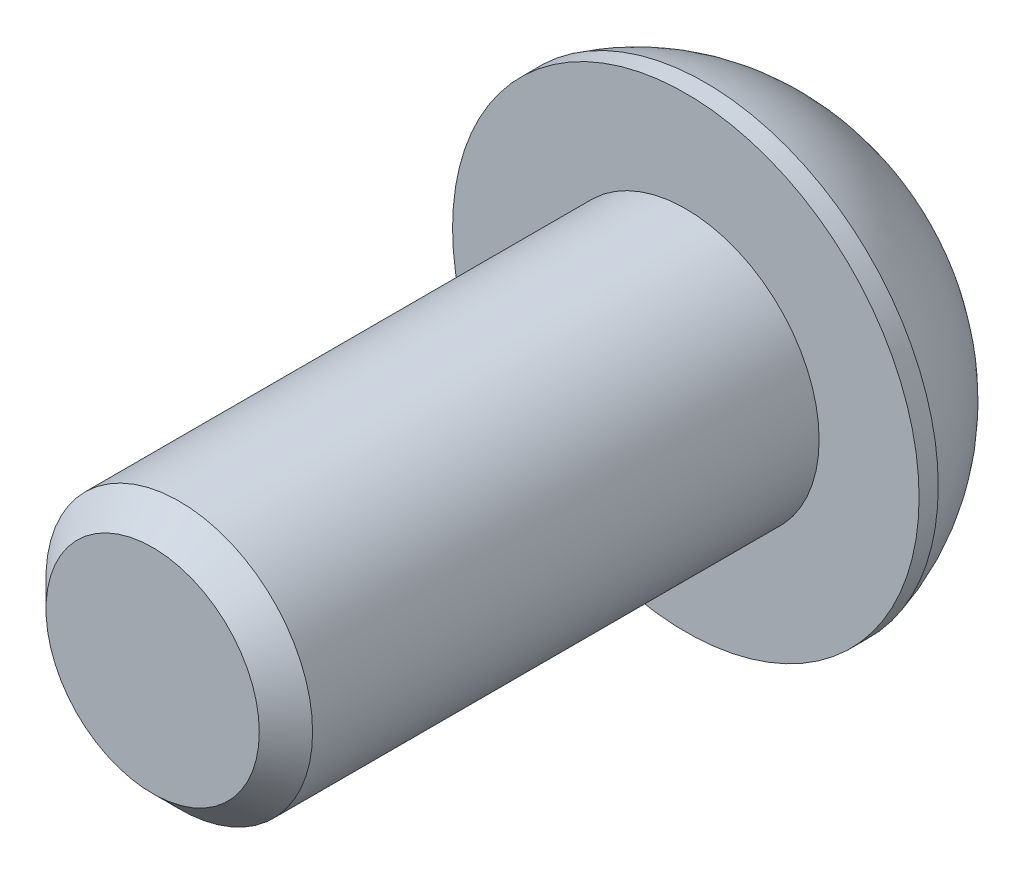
ISO-10303-21;
HEADER;
FILE_DESCRIPTION(('STEP AP214'),'2;1');
FILE_NAME('part.step','',(''),(''),'','','');
FILE_SCHEMA(('AUTOMOTIVE_DESIGN { 1 0 10303 214 1 1 1 1 }'));
ENDSEC;
DATA;
#1=APPLICATION_CONTEXT('core data for automotive mechanical design processes');
#2=APPLICATION_PROTOCOL_DEFINITION('international standard','automotive_design',2000,#1);
#3=PRODUCT_CONTEXT('',#1,'mechanical');
#4=PRODUCT('Part','Part','',(#3));
#5=PRODUCT_RELATED_PRODUCT_CATEGORY('part','',(#4));
#6=PRODUCT_DEFINITION_FORMATION('','',#4);
#7=PRODUCT_DEFINITION_CONTEXT('part definition',#1,'design');
#8=PRODUCT_DEFINITION('design','',#6,#7);
#9=PRODUCT_DEFINITION_SHAPE('','',#8);
#10=(LENGTH_UNIT() NAMED_UNIT(*) SI_UNIT(.MILLI.,.METRE.));
#11=(NAMED_UNIT(*) PLANE_ANGLE_UNIT() SI_UNIT($,.RADIAN.));
#12=(NAMED_UNIT(*) SI_UNIT($,.STERADIAN.) SOLID_ANGLE_UNIT());
#13=UNCERTAINTY_MEASURE_WITH_UNIT(LENGTH_MEASURE(1.E-05),#10,'distance_accuracy_value','');
#14=(GEOMETRIC_REPRESENTATION_CONTEXT(3) GLOBAL_UNCERTAINTY_ASSIGNED_CONTEXT((#13)) GLOBAL_UNIT_ASSIGNED_CONTEXT((#10,
#11,#12)) REPRESENTATION_CONTEXT('',''));
#15=CARTESIAN_POINT('',(0.,0.,0.));
#16=DIRECTION('',(0.,0.,1.));
#17=DIRECTION('',(1.,0.,0.));
#18=AXIS2_PLACEMENT_3D('',#15,#16,#17);
#19=CARTESIAN_POINT('',(0.,0.,-4.4));
#20=DIRECTION('',(0.,0.,1.));
#21=DIRECTION('',(1.,0.,0.));
#22=AXIS2_PLACEMENT_3D('',#19,#20,#21);
#23=PLANE('',#22);
#24=CARTESIAN_POINT('',(0.,0.,-4.4));
#25=DIRECTION('',(0.,0.,-1.));
#26=DIRECTION('',(-1.,0.,0.));
#27=AXIS2_PLACEMENT_3D('',#24,#25,#26);
#28=CIRCLE('',#27,4.06492341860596);
#29=CARTESIAN_POINT('',(-4.06492341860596,0.,-4.4));
#30=VERTEX_POINT('',#29);
#31=EDGE_CURVE('E149',#30,#30,#28,.T.);
#32=ORIENTED_EDGE('',*,*,#31,.T.);
#33=EDGE_LOOP('',(#32));
#34=FACE_BOUND('',#33,.T.);
#35=DIRECTION('',(-0.86602540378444,0.499999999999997,0.));
#36=VECTOR('',#35,1.);
#37=CARTESIAN_POINT('',(0.,2.88675134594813,-4.4));
#38=LINE('',#37,#36);
#39=CARTESIAN_POINT('',(2.5,1.44337567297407,-4.4));
#40=VERTEX_POINT('',#39);
#41=CARTESIAN_POINT('',(0.,2.88675134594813,-4.4));
#42=VERTEX_POINT('',#41);
#43=EDGE_CURVE('E51',#40,#42,#38,.T.);
#44=ORIENTED_EDGE('',*,*,#43,.T.);
#45=DIRECTION('',(-0.866025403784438,-0.500000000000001,0.));
#46=VECTOR('',#45,1.);
#47=CARTESIAN_POINT('',(0.,2.88675134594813,-4.4));
#48=LINE('',#47,#46);
#49=CARTESIAN_POINT('',(-2.5,1.44337567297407,-4.4));
#50=VERTEX_POINT('',#49);
#51=EDGE_CURVE('E122',#42,#50,#48,.T.);
#52=ORIENTED_EDGE('',*,*,#51,.T.);
#53=DIRECTION('',(0.,-1.,0.));
#54=VECTOR('',#53,1.);
#55=CARTESIAN_POINT('',(-2.5,-1.44337567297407,-4.4));
#56=LINE('',#55,#54);
#57=CARTESIAN_POINT('',(-2.5,-1.44337567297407,-4.4));
#58=VERTEX_POINT('',#57);
#59=EDGE_CURVE('E126',#50,#58,#56,.T.);
#60=ORIENTED_EDGE('',*,*,#59,.T.);
#61=DIRECTION('',(0.866025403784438,-0.500000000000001,0.));
#62=VECTOR('',#61,1.);
#63=CARTESIAN_POINT('',(0.,-2.88675134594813,-4.4));
#64=LINE('',#63,#62);
#65=CARTESIAN_POINT('',(0.,-2.88675134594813,-4.4));
#66=VERTEX_POINT('',#65);
#67=EDGE_CURVE('E129',#58,#66,#64,.T.);
#68=ORIENTED_EDGE('',*,*,#67,.T.);
#69=DIRECTION('',(0.86602540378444,0.499999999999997,0.));
#70=VECTOR('',#69,1.);
#71=CARTESIAN_POINT('',(0.,-2.88675134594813,-4.4));
#72=LINE('',#71,#70);
#73=CARTESIAN_POINT('',(2.5,-1.44337567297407,-4.4));
#74=VERTEX_POINT('',#73);
#75=EDGE_CURVE('E112',#66,#74,#72,.T.);
#76=ORIENTED_EDGE('',*,*,#75,.T.);
#77=DIRECTION('',(0.,1.,0.));
#78=VECTOR('',#77,1.);
#79=CARTESIAN_POINT('',(2.5,-1.44337567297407,-4.4));
#80=LINE('',#79,#78);
#81=EDGE_CURVE('E132',#74,#40,#80,.T.);
#82=ORIENTED_EDGE('',*,*,#81,.T.);
#83=EDGE_LOOP('',(#44,#52,#60,#68,#76,#82));
#84=FACE_BOUND('',#83,.T.);
#85=ADVANCED_FACE('F36',(#34,#84),#23,.F.);
#86=CARTESIAN_POINT('',(0.,0.,1.05548398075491));
#87=DIRECTION('',(0.,0.,-1.));
#88=DIRECTION('',(-1.,0.,0.));
#89=AXIS2_PLACEMENT_3D('',#86,#87,#88);
#90=DEGENERATE_TOROIDAL_SURFACE('',#89,0.915198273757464,6.29945028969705,.T.);
#91=ORIENTED_EDGE('',*,*,#31,.F.);
#92=EDGE_LOOP('',(#91));
#93=FACE_BOUND('',#92,.T.);
#94=CARTESIAN_POINT('',(0.,0.,-0.574933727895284));
#95=DIRECTION('',(0.,0.,-1.));
#96=DIRECTION('',(-1.,0.,0.));
#97=AXIS2_PLACEMENT_3D('',#94,#95,#96);
#98=CIRCLE('',#97,7.);
#99=CARTESIAN_POINT('',(-7.,0.,-0.574933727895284));
#100=VERTEX_POINT('',#99);
#101=EDGE_CURVE('E146',#100,#100,#98,.T.);
#102=ORIENTED_EDGE('',*,*,#101,.T.);
#103=EDGE_LOOP('',(#102));
#104=FACE_BOUND('',#103,.T.);
#105=ADVANCED_FACE('F166',(#93,#104),#90,.T.);
#106=CARTESIAN_POINT('',(0.,0.,0.));
#107=DIRECTION('',(0.,0.,-1.));
#108=DIRECTION('',(-1.,0.,0.));
#109=AXIS2_PLACEMENT_3D('',#106,#107,#108);
#110=CYLINDRICAL_SURFACE('',#109,7.);
#111=ORIENTED_EDGE('',*,*,#101,.F.);
#112=EDGE_LOOP('',(#111));
#113=FACE_BOUND('',#112,.T.);
#114=CARTESIAN_POINT('',(0.,0.,0.));
#115=DIRECTION('',(0.,0.,-1.));
#116=DIRECTION('',(-1.,0.,0.));
#117=AXIS2_PLACEMENT_3D('',#114,#115,#116);
#118=CIRCLE('',#117,7.);
#119=CARTESIAN_POINT('',(-7.,0.,0.));
#120=VERTEX_POINT('',#119);
#121=EDGE_CURVE('E143',#120,#120,#118,.T.);
#122=ORIENTED_EDGE('',*,*,#121,.T.);
#123=EDGE_LOOP('',(#122));
#124=FACE_BOUND('',#123,.T.);
#125=ADVANCED_FACE('F171',(#113,#124),#110,.T.);
#126=CARTESIAN_POINT('',(0.,0.,0.));
#127=DIRECTION('',(0.,0.,-1.));
#128=DIRECTION('',(-1.,0.,0.));
#129=AXIS2_PLACEMENT_3D('',#126,#127,#128);
#130=PLANE('',#129);
#131=CARTESIAN_POINT('',(0.,0.,0.));
#132=DIRECTION('',(0.,0.,1.));
#133=DIRECTION('',(1.,0.,0.));
#134=AXIS2_PLACEMENT_3D('',#131,#132,#133);
#135=CIRCLE('',#134,4.);
#136=CARTESIAN_POINT('',(4.,0.,0.));
#137=VERTEX_POINT('',#136);
#138=EDGE_CURVE('E123',#137,#137,#135,.T.);
#139=ORIENTED_EDGE('',*,*,#138,.F.);
#140=EDGE_LOOP('',(#139));
#141=FACE_BOUND('',#140,.T.);
#142=ORIENTED_EDGE('',*,*,#121,.F.);
#143=EDGE_LOOP('',(#142));
#144=FACE_BOUND('',#143,.T.);
#145=ADVANCED_FACE('F178',(#141,#144),#130,.F.);
#146=CARTESIAN_POINT('',(0.,2.88675134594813,-1.8));
#147=DIRECTION('',(-0.499999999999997,-0.86602540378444,0.));
#148=DIRECTION('',(0.86602540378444,-0.499999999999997,0.));
#149=AXIS2_PLACEMENT_3D('',#146,#147,#148);
#150=PLANE('',#149);
#151=ORIENTED_EDGE('',*,*,#43,.F.);
#152=DIRECTION('',(0.,0.,-1.));
#153=VECTOR('',#152,1.);
#154=CARTESIAN_POINT('',(2.5,1.44337567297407,-1.8));
#155=LINE('',#154,#153);
#156=CARTESIAN_POINT('',(2.5,1.44337567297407,-1.8));
#157=VERTEX_POINT('',#156);
#158=EDGE_CURVE('E117',#157,#40,#155,.T.);
#159=ORIENTED_EDGE('',*,*,#158,.F.);
#160=DIRECTION('',(-0.86602540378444,0.499999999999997,0.));
#161=VECTOR('',#160,1.);
#162=CARTESIAN_POINT('',(0.,2.88675134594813,-1.8));
#163=LINE('',#162,#161);
#164=CARTESIAN_POINT('',(0.,2.88675134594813,-1.8));
#165=VERTEX_POINT('',#164);
#166=EDGE_CURVE('E135',#157,#165,#163,.T.);
#167=ORIENTED_EDGE('',*,*,#166,.T.);
#168=DIRECTION('',(0.,0.,-1.));
#169=VECTOR('',#168,1.);
#170=CARTESIAN_POINT('',(0.,2.88675134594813,-1.8));
#171=LINE('',#170,#169);
#172=EDGE_CURVE('E141',#165,#42,#171,.T.);
#173=ORIENTED_EDGE('',*,*,#172,.T.);
#174=EDGE_LOOP('',(#151,#159,#167,#173));
#175=FACE_BOUND('',#174,.T.);
#176=ADVANCED_FACE('F182',(#175),#150,.T.);
#177=CARTESIAN_POINT('',(0.,2.88675134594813,-1.8));
#178=DIRECTION('',(0.500000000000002,-0.866025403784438,0.));
#179=DIRECTION('',(0.866025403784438,0.500000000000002,0.));
#180=AXIS2_PLACEMENT_3D('',#177,#178,#179);
#181=PLANE('',#180);
#182=ORIENTED_EDGE('',*,*,#51,.F.);
#183=ORIENTED_EDGE('',*,*,#172,.F.);
#184=DIRECTION('',(-0.866025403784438,-0.500000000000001,0.));
#185=VECTOR('',#184,1.);
#186=CARTESIAN_POINT('',(0.,2.88675134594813,-1.8));
#187=LINE('',#186,#185);
#188=CARTESIAN_POINT('',(-2.5,1.44337567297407,-1.8));
#189=VERTEX_POINT('',#188);
#190=EDGE_CURVE('E90',#165,#189,#187,.T.);
#191=ORIENTED_EDGE('',*,*,#190,.T.);
#192=DIRECTION('',(0.,0.,-1.));
#193=VECTOR('',#192,1.);
#194=CARTESIAN_POINT('',(-2.5,1.44337567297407,-1.8));
#195=LINE('',#194,#193);
#196=EDGE_CURVE('E139',#189,#50,#195,.T.);
#197=ORIENTED_EDGE('',*,*,#196,.T.);
#198=EDGE_LOOP('',(#182,#183,#191,#197));
#199=FACE_BOUND('',#198,.T.);
#200=ADVANCED_FACE('F186',(#199),#181,.T.);
#201=CARTESIAN_POINT('',(-2.5,-1.44337567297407,-1.8));
#202=DIRECTION('',(1.,0.,0.));
#203=DIRECTION('',(0.,0.,-1.));
#204=AXIS2_PLACEMENT_3D('',#201,#202,#203);
#205=PLANE('',#204);
#206=ORIENTED_EDGE('',*,*,#59,.F.);
#207=ORIENTED_EDGE('',*,*,#196,.F.);
#208=DIRECTION('',(0.,-1.,0.));
#209=VECTOR('',#208,1.);
#210=CARTESIAN_POINT('',(-2.5,-1.44337567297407,-1.8));
#211=LINE('',#210,#209);
#212=CARTESIAN_POINT('',(-2.5,-1.44337567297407,-1.8));
#213=VERTEX_POINT('',#212);
#214=EDGE_CURVE('E108',#189,#213,#211,.T.);
#215=ORIENTED_EDGE('',*,*,#214,.T.);
#216=DIRECTION('',(0.,0.,-1.));
#217=VECTOR('',#216,1.);
#218=CARTESIAN_POINT('',(-2.5,-1.44337567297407,-1.8));
#219=LINE('',#218,#217);
#220=EDGE_CURVE('E105',#213,#58,#219,.T.);
#221=ORIENTED_EDGE('',*,*,#220,.T.);
#222=EDGE_LOOP('',(#206,#207,#215,#221));
#223=FACE_BOUND('',#222,.T.);
#224=ADVANCED_FACE('F189',(#223),#205,.T.);
#225=CARTESIAN_POINT('',(0.,-2.88675134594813,-1.8));
#226=DIRECTION('',(0.500000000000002,0.866025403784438,0.));
#227=DIRECTION('',(-0.866025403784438,0.500000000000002,0.));
#228=AXIS2_PLACEMENT_3D('',#225,#226,#227);
#229=PLANE('',#228);
#230=ORIENTED_EDGE('',*,*,#67,.F.);
#231=ORIENTED_EDGE('',*,*,#220,.F.);
#232=DIRECTION('',(0.866025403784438,-0.500000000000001,0.));
#233=VECTOR('',#232,1.);
#234=CARTESIAN_POINT('',(0.,-2.88675134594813,-1.8));
#235=LINE('',#234,#233);
#236=CARTESIAN_POINT('',(0.,-2.88675134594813,-1.8));
#237=VERTEX_POINT('',#236);
#238=EDGE_CURVE('E100',#213,#237,#235,.T.);
#239=ORIENTED_EDGE('',*,*,#238,.T.);
#240=DIRECTION('',(0.,0.,-1.));
#241=VECTOR('',#240,1.);
#242=CARTESIAN_POINT('',(0.,-2.88675134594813,-1.8));
#243=LINE('',#242,#241);
#244=EDGE_CURVE('E104',#237,#66,#243,.T.);
#245=ORIENTED_EDGE('',*,*,#244,.T.);
#246=EDGE_LOOP('',(#230,#231,#239,#245));
#247=FACE_BOUND('',#246,.T.);
#248=ADVANCED_FACE('F103',(#247),#229,.T.);
#249=CARTESIAN_POINT('',(0.,-2.88675134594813,-1.8));
#250=DIRECTION('',(-0.499999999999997,0.86602540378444,0.));
#251=DIRECTION('',(-0.86602540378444,-0.499999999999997,0.));
#252=AXIS2_PLACEMENT_3D('',#249,#250,#251);
#253=PLANE('',#252);
#254=ORIENTED_EDGE('',*,*,#75,.F.);
#255=ORIENTED_EDGE('',*,*,#244,.F.);
#256=DIRECTION('',(0.86602540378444,0.499999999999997,0.));
#257=VECTOR('',#256,1.);
#258=CARTESIAN_POINT('',(0.,-2.88675134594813,-1.8));
#259=LINE('',#258,#257);
#260=CARTESIAN_POINT('',(2.5,-1.44337567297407,-1.8));
#261=VERTEX_POINT('',#260);
#262=EDGE_CURVE('E107',#237,#261,#259,.T.);
#263=ORIENTED_EDGE('',*,*,#262,.T.);
#264=DIRECTION('',(0.,0.,-1.));
#265=VECTOR('',#264,1.);
#266=CARTESIAN_POINT('',(2.5,-1.44337567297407,-1.8));
#267=LINE('',#266,#265);
#268=EDGE_CURVE('E81',#261,#74,#267,.T.);
#269=ORIENTED_EDGE('',*,*,#268,.T.);
#270=EDGE_LOOP('',(#254,#255,#263,#269));
#271=FACE_BOUND('',#270,.T.);
#272=ADVANCED_FACE('F110',(#271),#253,.T.);
#273=CARTESIAN_POINT('',(2.5,-1.44337567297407,-1.8));
#274=DIRECTION('',(-1.,0.,0.));
#275=DIRECTION('',(0.,0.,1.));
#276=AXIS2_PLACEMENT_3D('',#273,#274,#275);
#277=PLANE('',#276);
#278=ORIENTED_EDGE('',*,*,#81,.F.);
#279=ORIENTED_EDGE('',*,*,#268,.F.);
#280=DIRECTION('',(0.,1.,0.));
#281=VECTOR('',#280,1.);
#282=CARTESIAN_POINT('',(2.5,-1.44337567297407,-1.8));
#283=LINE('',#282,#281);
#284=EDGE_CURVE('E59',#261,#157,#283,.T.);
#285=ORIENTED_EDGE('',*,*,#284,.T.);
#286=ORIENTED_EDGE('',*,*,#158,.T.);
#287=EDGE_LOOP('',(#278,#279,#285,#286));
#288=FACE_BOUND('',#287,.T.);
#289=ADVANCED_FACE('F198',(#288),#277,.T.);
#290=CARTESIAN_POINT('',(2.5,1.44337567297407,-1.8));
#291=DIRECTION('',(0.,0.,1.));
#292=DIRECTION('',(1.,0.,0.));
#293=AXIS2_PLACEMENT_3D('',#290,#291,#292);
#294=PLANE('',#293);
#295=ORIENTED_EDGE('',*,*,#166,.F.);
#296=ORIENTED_EDGE('',*,*,#284,.F.);
#297=ORIENTED_EDGE('',*,*,#262,.F.);
#298=ORIENTED_EDGE('',*,*,#238,.F.);
#299=ORIENTED_EDGE('',*,*,#214,.F.);
#300=ORIENTED_EDGE('',*,*,#190,.F.);
#301=EDGE_LOOP('',(#295,#296,#297,#298,#299,#300));
#302=FACE_BOUND('',#301,.T.);
#303=ADVANCED_FACE('F115',(#302),#294,.F.);
#304=CARTESIAN_POINT('',(0.,0.,16.));
#305=DIRECTION('',(0.,0.,1.));
#306=DIRECTION('',(1.,0.,0.));
#307=AXIS2_PLACEMENT_3D('',#304,#305,#306);
#308=PLANE('',#307);
#309=CARTESIAN_POINT('',(0.,0.,16.));
#310=DIRECTION('',(0.,0.,1.));
#311=DIRECTION('',(1.,0.,0.));
#312=AXIS2_PLACEMENT_3D('',#309,#310,#311);
#313=CIRCLE('',#312,3.2);
#314=CARTESIAN_POINT('',(3.2,0.,16.));
#315=VERTEX_POINT('',#314);
#316=EDGE_CURVE('E44',#315,#315,#313,.T.);
#317=ORIENTED_EDGE('',*,*,#316,.T.);
#318=EDGE_LOOP('',(#317));
#319=FACE_BOUND('',#318,.T.);
#320=ADVANCED_FACE('F154',(#319),#308,.T.);
#321=CARTESIAN_POINT('',(0.,0.,0.));
#322=DIRECTION('',(0.,0.,1.));
#323=DIRECTION('',(1.,0.,0.));
#324=AXIS2_PLACEMENT_3D('',#321,#322,#323);
#325=CYLINDRICAL_SURFACE('',#324,4.);
#326=CARTESIAN_POINT('',(0.,0.,15.2));
#327=DIRECTION('',(0.,0.,1.));
#328=DIRECTION('',(1.,0.,0.));
#329=AXIS2_PLACEMENT_3D('',#326,#327,#328);
#330=CIRCLE('',#329,4.);
#331=CARTESIAN_POINT('',(4.,0.,15.2));
#332=VERTEX_POINT('',#331);
#333=EDGE_CURVE('E11',#332,#332,#330,.F.);
#334=ORIENTED_EDGE('',*,*,#333,.T.);
#335=EDGE_LOOP('',(#334));
#336=FACE_BOUND('',#335,.T.);
#337=ORIENTED_EDGE('',*,*,#138,.T.);
#338=EDGE_LOOP('',(#337));
#339=FACE_BOUND('',#338,.T.);
#340=ADVANCED_FACE('F157',(#336,#339),#325,.T.);
#341=CARTESIAN_POINT('',(0.,0.,16.));
#342=DIRECTION('',(0.,0.,-1.));
#343=DIRECTION('',(-1.,0.,0.));
#344=AXIS2_PLACEMENT_3D('',#341,#342,#343);
#345=CONICAL_SURFACE('',#344,3.2,0.785398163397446);
#346=ORIENTED_EDGE('',*,*,#333,.F.);
#347=EDGE_LOOP('',(#346));
#348=FACE_BOUND('',#347,.T.);
#349=ORIENTED_EDGE('',*,*,#316,.F.);
#350=EDGE_LOOP('',(#349));
#351=FACE_BOUND('',#350,.T.);
#352=ADVANCED_FACE('F38',(#348,#351),#345,.T.);
#353=CLOSED_SHELL('',(#85,#105,#125,#145,#176,#200,#224,#248,#272,#289,#303,#320,#340,#352));
#354=MANIFOLD_SOLID_BREP('B2',#353);
#355=ADVANCED_BREP_SHAPE_REPRESENTATION('',(#18,#354),#14);
#356=SHAPE_DEFINITION_REPRESENTATION(#9,#355);
ENDSEC;
END-ISO-10303-21;
